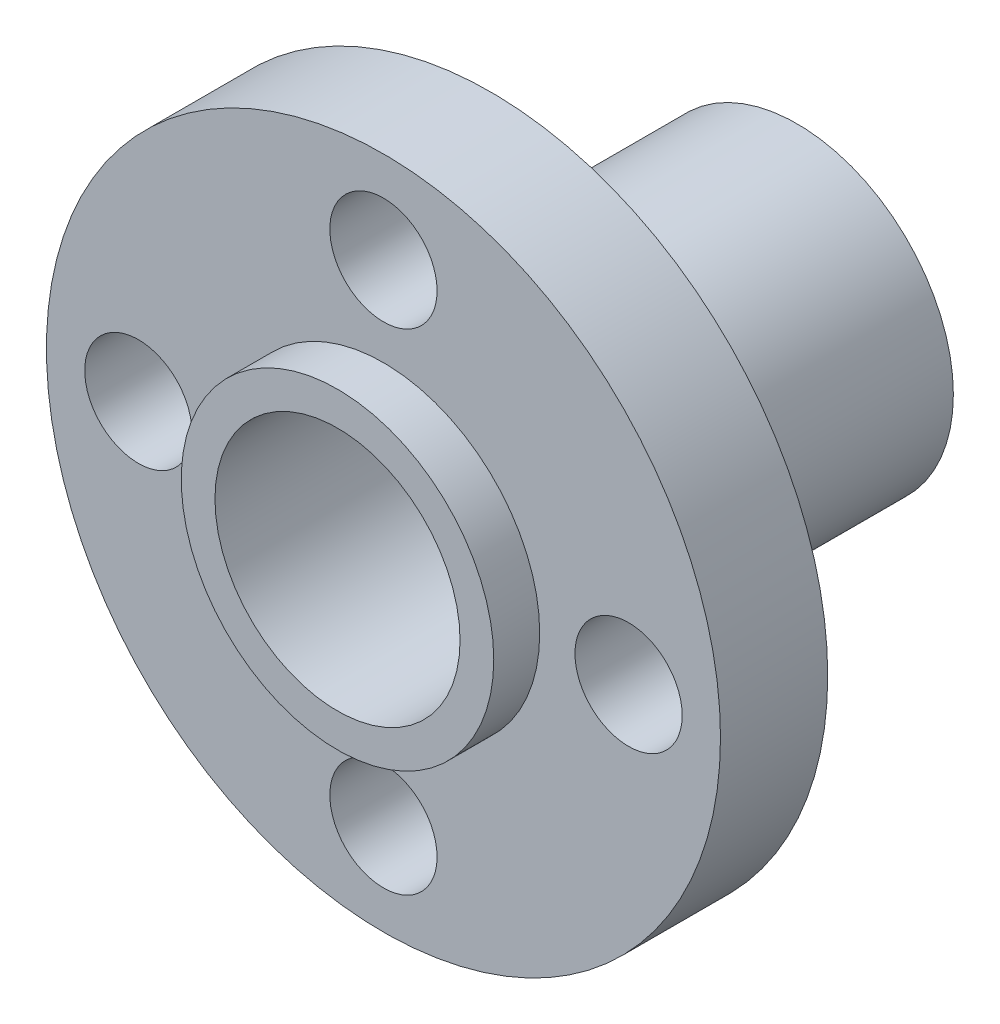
from build123d import *
from build123d.topology import SkipClean

# Parameters (mm, degrees)
SKETCH1_R           = 11
SKETCH1_R_2         = 1.75
SKETCH1_R_3         = 4
BOSS_EXTRUDE1_DEPTH = 3.5
BOSS_EXTRUDE2_START = 10
SKETCH2_R           = 5.1
SKETCH2_R_2         = 4
BOSS_EXTRUDE2_DEPTH = 10
SKETCH3_R           = 5.1
SKETCH3_R_2         = 4
BOSS_EXTRUDE3_DEPTH = 1.5


with BuildPart() as part:
    # Sketch1 → Boss-Extrude1 (new body)
    with BuildSketch(Plane.XY):
        Circle(SKETCH1_R)
        with Locations((0, 8)):
            Circle(SKETCH1_R_2, mode=Mode.SUBTRACT)
        with Locations((8, 0)):
            Circle(SKETCH1_R_2, mode=Mode.SUBTRACT)
        with Locations((0, -8)):
            Circle(SKETCH1_R_2, mode=Mode.SUBTRACT)
        with Locations((-8, 0)):
            Circle(SKETCH1_R_2, mode=Mode.SUBTRACT)
        Circle(SKETCH1_R_3, mode=Mode.SUBTRACT)
    extrude(amount=BOSS_EXTRUDE1_DEPTH)

    # Sketch2 → Boss-Extrude2 (add)
    with SkipClean():  # the faces are left unmerged after this step: merging them gives an invalid solid
        with BuildSketch(Plane(origin=(0, 0, 0), x_dir=(-1, 0, 0), z_dir=(0, 0, -1)).offset(BOSS_EXTRUDE2_START)):
            with Locations(Location((0, 0, 0), (0, 0, 180))):
                Circle(SKETCH2_R)
            Circle(SKETCH2_R_2, mode=Mode.SUBTRACT)
        extrude(amount=-BOSS_EXTRUDE2_DEPTH)

    # Sketch3 → Boss-Extrude3 (add)
    with BuildSketch(Plane.XY.offset(3.5)):
        Circle(SKETCH3_R)
        with Locations(Location((0, 0, 0), (0, 0, 180))):
            Circle(SKETCH3_R_2, mode=Mode.SUBTRACT)
    extrude(amount=BOSS_EXTRUDE3_DEPTH)


solid = part.part
